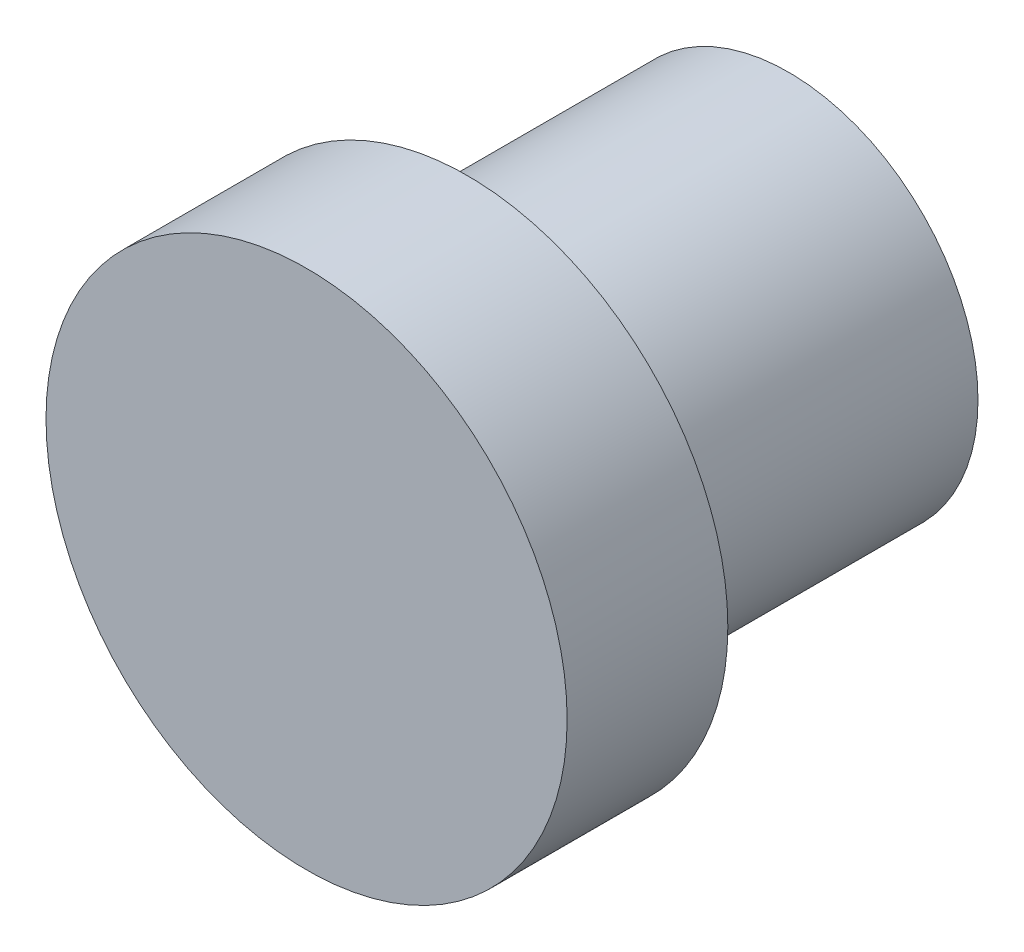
from build123d import *

# Parameters (mm, degrees)
SKETCH1_R           = 2.992510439
BOSS_EXTRUDE1_DEPTH = 5.08
SKETCH2_R           = 4.118543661
BOSS_EXTRUDE2_DEPTH = 2.54


with BuildPart() as part:
    # Sketch1 → Boss-Extrude1 (new body)
    with BuildSketch(Plane.XY):
        Circle(SKETCH1_R)
    extrude(amount=-BOSS_EXTRUDE1_DEPTH)

    # Sketch2 → Boss-Extrude2 (add)
    with BuildSketch(Plane.XY):
        Circle(SKETCH2_R)
    extrude(amount=BOSS_EXTRUDE2_DEPTH)


solid = part.part
